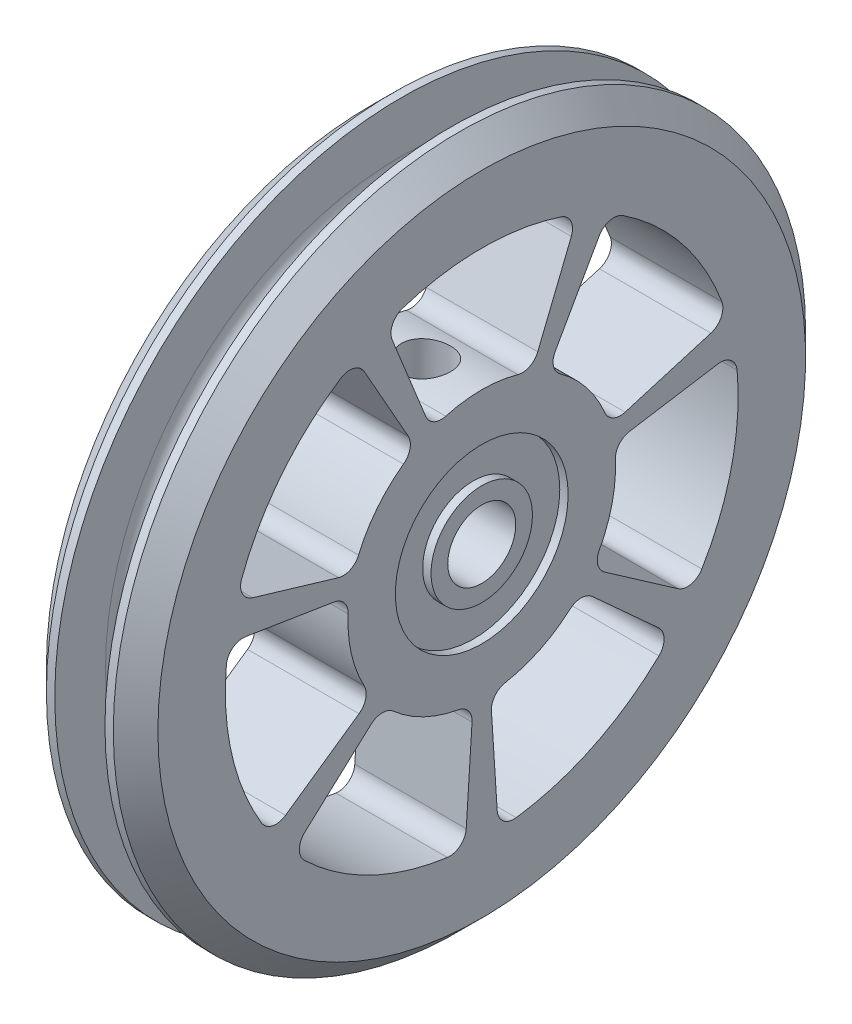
from build123d import *

# Parameters (mm, degrees)
ENL_V_MAT_EXTRU_2_DEPTH = 46.035597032
ESQUISSE9_W             = 2.2
ESQUISSE9_H             = 12
ESQUISSE10_R            = 1.5
ENL_V_MAT_EXTRU_3_DEPTH = 22
ESQUISSE11_R            = 7.75
ESQUISSE11_R_2          = 4.55
ENL_V_MAT_EXTRU_4_DEPTH = 0.75


with BuildPart() as part:
    # Esquisse1 → R_volution1 (revolve)
    with BuildSketch(Plane.XY, mode=Mode.PRIVATE) as r_volution1_sk:
        with BuildLine():
            Line((3, 31.05), (5, 29.05))
            Line((5, 29.05), (5, 3.05))
            Line((5, 3.05), (-5, 3.05))
            Line((-5, 3.05), (-5, 29.05))
            Line((-5, 29.05), (-3, 31.05))
            Line((-3, 31.05), (-2.25, 31.05))
            Line((-2.25, 31.05), (-2.25, 26.5))
            ThreePointArc((-2.25, 26.5), (-1.810660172, 25.439339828), (-0.75, 25))
            Line((-0.75, 25), (0.75, 25))
            ThreePointArc((0.75, 25), (1.810660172, 25.439339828), (2.25, 26.5))
            Line((2.25, 26.5), (2.25, 31.05))
            Line((2.25, 31.05), (3, 31.05))
        make_face()
    revolve(r_volution1_sk.sketch.rotate(Axis((-19.082826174, 0, 0), (1, 0, 0)), 90), axis=Axis((-19.082826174, 0, 0), (1, 0, 0)))

    # Esquisse7 → Enl_v. mat.-Extru.2 (cut, through all)
    with BuildSketch(Plane.ZY.offset(5)):
        with BuildLine():
            Line((-5.025874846, 12.439476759), (-8.03441634, 19.885878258))
            ThreePointArc((-8.03441634, 19.885878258), (-8.003098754, 21.081723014), (-7.107150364, 21.874378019))
            ThreePointArc((-7.107150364, 21.874378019), (0, 23), (7.107150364, 21.874378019))
            ThreePointArc((7.107150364, 21.874378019), (8.003098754, 21.081723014), (8.03441634, 19.885878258))
            Line((8.03441634, 19.885878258), (5.025874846, 12.439476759))
            ThreePointArc((5.025874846, 12.439476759), (4.297115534, 11.65537989), (3.231199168, 11.556788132))
            ThreePointArc((3.231199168, 11.556788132), (0, 12), (-3.231199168, 11.556788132))
            ThreePointArc((-3.231199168, 11.556788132), (-4.297115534, 11.65537989), (-5.025874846, 12.439476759))
        make_face()
        with BuildLine():
            Line((6.591992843, 11.685274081), (10.538029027, 18.680201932))
            ThreePointArc((10.538029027, 18.680201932), (11.492504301, 19.401313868), (12.670841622, 19.195045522))
            ThreePointArc((12.670841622, 19.195045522), (17.982124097, 14.340265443), (21.533313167, 8.081857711))
            ThreePointArc((21.533313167, 8.081857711), (21.472205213, 6.887164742), (20.55678233, 6.117082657))
            Line((20.55678233, 6.117082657), (12.859156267, 3.826499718))
            ThreePointArc((12.859156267, 3.826499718), (11.791750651, 3.90739029), (11.050080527, 4.679286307))
            ThreePointArc((11.050080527, 4.679286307), (9.38197779, 7.481877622), (7.020841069, 9.731792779))
            ThreePointArc((7.020841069, 9.731792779), (6.433335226, 10.626630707), (6.591992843, 11.685274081))
        make_face()
        with BuildLine():
            Line((13.24595547, 2.131821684), (21.175123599, 3.407952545))
            ThreePointArc((21.175123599, 3.407952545), (22.334017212, 3.111319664), (22.907431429, 2.06145224))
            ThreePointArc((22.907431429, 2.06145224), (22.42334198, -5.117981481), (19.744451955, -11.796466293))
            ThreePointArc((19.744451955, -11.796466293), (18.772303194, -12.493569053), (17.599471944, -12.25800095))
            Line((17.599471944, -12.25800095), (11.00923074, -7.667909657))
            ThreePointArc((11.00923074, -7.667909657), (10.40695702, -6.782943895), (10.548025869, -5.721813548))
            ThreePointArc((10.548025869, -5.721813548), (11.699134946, -2.670251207), (11.986044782, 0.57855897))
            ThreePointArc((11.986044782, 0.57855897), (12.319353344, 1.595811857), (13.24595547, 2.131821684))
        make_face()
        with BuildLine():
            Line((9.925443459, -9.026935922), (15.866918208, -14.430554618))
            ThreePointArc((15.866918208, -14.430554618), (16.357559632, -15.521561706), (15.894258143, -16.624456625))
            ThreePointArc((15.894258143, -16.624456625), (9.979326, -20.722283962), (3.087615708, -22.791810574))
            ThreePointArc((3.087615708, -22.791810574), (1.936473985, -22.466390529), (1.38940022, -21.402559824))
            Line((1.38940022, -21.402559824), (0.869129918, -13.388226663))
            ThreePointArc((0.869129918, -13.388226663), (1.18551249, -12.36558298), (2.10309259, -11.814271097))
            ThreePointArc((2.10309259, -11.814271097), (5.206604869, -10.811626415), (7.925512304, -9.010341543))
            ThreePointArc((7.925512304, -9.010341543), (8.928647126, -8.636685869), (9.925443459, -9.026935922))
        make_face()
        with BuildLine():
            Line((-0.869129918, -13.388226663), (-1.38940022, -21.402559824))
            ThreePointArc((-1.38940022, -21.402559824), (-1.936473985, -22.466390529), (-3.087615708, -22.791810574))
            ThreePointArc((-3.087615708, -22.791810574), (-9.979326, -20.722283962), (-15.894258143, -16.624456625))
            ThreePointArc((-15.894258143, -16.624456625), (-16.357559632, -15.521561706), (-15.866918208, -14.430554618))
            Line((-15.866918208, -14.430554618), (-9.925443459, -9.026935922))
            ThreePointArc((-9.925443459, -9.026935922), (-8.928647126, -8.636685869), (-7.925512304, -9.010341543))
            ThreePointArc((-7.925512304, -9.010341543), (-5.206604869, -10.811626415), (-2.10309259, -11.814271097))
            ThreePointArc((-2.10309259, -11.814271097), (-1.18551249, -12.36558298), (-0.869129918, -13.388226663))
        make_face()
        with BuildLine():
            Line((-11.00923074, -7.667909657), (-17.599471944, -12.25800095))
            ThreePointArc((-17.599471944, -12.25800095), (-18.772303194, -12.493569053), (-19.744451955, -11.796466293))
            ThreePointArc((-19.744451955, -11.796466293), (-22.42334198, -5.117981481), (-22.907431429, 2.06145224))
            ThreePointArc((-22.907431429, 2.06145224), (-22.334017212, 3.111319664), (-21.175123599, 3.407952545))
            Line((-21.175123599, 3.407952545), (-13.24595547, 2.131821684))
            ThreePointArc((-13.24595547, 2.131821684), (-12.319353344, 1.595811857), (-11.986044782, 0.57855897))
            ThreePointArc((-11.986044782, 0.57855897), (-11.699134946, -2.670251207), (-10.548025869, -5.721813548))
            ThreePointArc((-10.548025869, -5.721813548), (-10.40695702, -6.782943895), (-11.00923074, -7.667909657))
        make_face()
        with BuildLine():
            Line((-12.859156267, 3.826499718), (-20.55678233, 6.117082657))
            ThreePointArc((-20.55678233, 6.117082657), (-21.472205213, 6.887164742), (-21.533313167, 8.081857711))
            ThreePointArc((-21.533313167, 8.081857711), (-17.982124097, 14.340265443), (-12.670841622, 19.195045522))
            ThreePointArc((-12.670841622, 19.195045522), (-11.492504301, 19.401313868), (-10.538029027, 18.680201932))
            Line((-10.538029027, 18.680201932), (-6.591992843, 11.685274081))
            ThreePointArc((-6.591992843, 11.685274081), (-6.433335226, 10.626630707), (-7.020841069, 9.731792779))
            ThreePointArc((-7.020841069, 9.731792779), (-9.38197779, 7.481877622), (-11.050080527, 4.679286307))
            ThreePointArc((-11.050080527, 4.679286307), (-11.791750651, 3.90739029), (-12.859156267, 3.826499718))
        make_face()
    extrude(amount=-ENL_V_MAT_EXTRU_2_DEPTH, mode=Mode.SUBTRACT)

    # Esquisse9 → Diam_tre du per_age _4.4 _4.4_1 (revolve, cut)
    with BuildSketch(Plane(origin=(0, 0, 0), x_dir=(0, 0, -1), z_dir=(1, 0, 0))):
        with Locations((1.1, 6)):
            Rectangle(ESQUISSE9_W, ESQUISSE9_H)
    revolve(axis=Axis((0, -6.35, 0), (0, 1, 0)), mode=Mode.SUBTRACT)

    # Esquisse10 → Enl_v. mat.-Extru.3 (cut)
    with BuildSketch(Plane(origin=(0, 19.885878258, 0), x_dir=(1, 0, 0), z_dir=(0, 1, 0))):
        with Locations(Location((0, 0, 0), (0, 0, 90))):
            Circle(ESQUISSE10_R)
    extrude(amount=ENL_V_MAT_EXTRU_3_DEPTH, mode=Mode.SUBTRACT)

    # Esquisse11 → Enl_v. mat.-Extru.4 (cut)
    with BuildSketch(Plane(origin=(5, 0, 0), x_dir=(0, 0, -1), z_dir=(1, 0, 0))):
        Circle(ESQUISSE11_R)
        Circle(ESQUISSE11_R_2, mode=Mode.SUBTRACT)
    enl_v_mat_extru_4 = extrude(amount=-ENL_V_MAT_EXTRU_4_DEPTH, mode=Mode.SUBTRACT)

    # Sym_trie1: Enl_v. mat.-Extru.4 across plane
    add(enl_v_mat_extru_4.mirror(Plane(origin=(0, 0, 0), x_dir=(0, 0, 1), z_dir=(1, 0, 0))), mode=Mode.SUBTRACT)


solid = part.part
